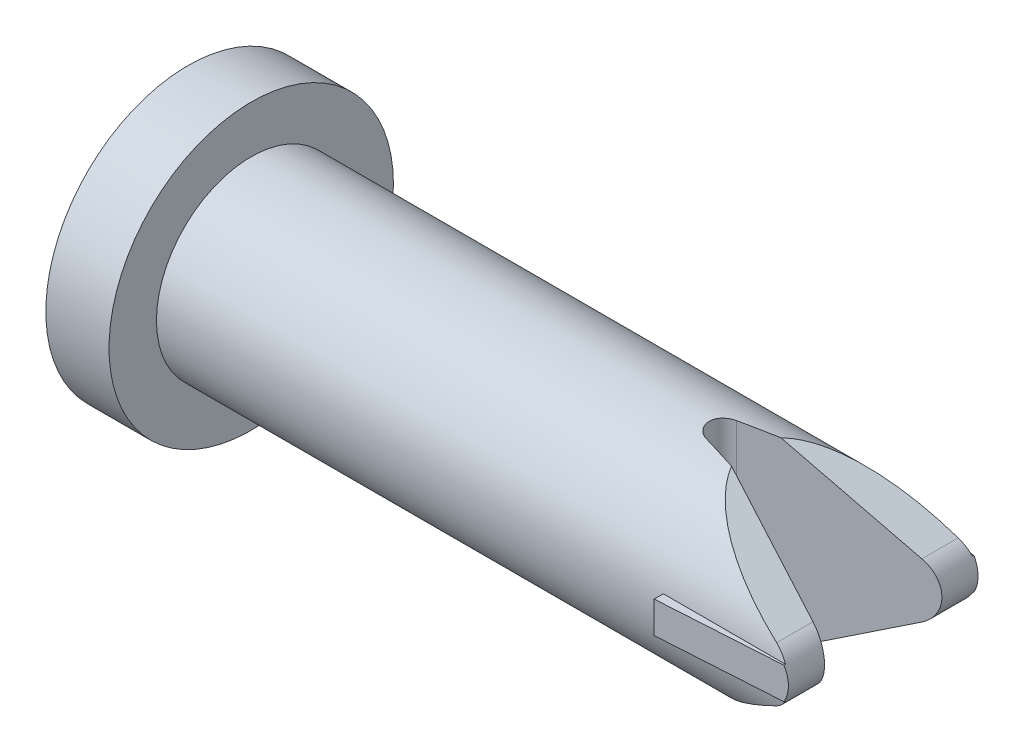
ISO-10303-21;
HEADER;
FILE_DESCRIPTION(('STEP AP214'),'2;1');
FILE_NAME('part.step','',(''),(''),'','','');
FILE_SCHEMA(('AUTOMOTIVE_DESIGN { 1 0 10303 214 1 1 1 1 }'));
ENDSEC;
DATA;
#1=APPLICATION_CONTEXT('core data for automotive mechanical design processes');
#2=APPLICATION_PROTOCOL_DEFINITION('international standard','automotive_design',2000,#1);
#3=PRODUCT_CONTEXT('',#1,'mechanical');
#4=PRODUCT('Part','Part','',(#3));
#5=PRODUCT_RELATED_PRODUCT_CATEGORY('part','',(#4));
#6=PRODUCT_DEFINITION_FORMATION('','',#4);
#7=PRODUCT_DEFINITION_CONTEXT('part definition',#1,'design');
#8=PRODUCT_DEFINITION('design','',#6,#7);
#9=PRODUCT_DEFINITION_SHAPE('','',#8);
#10=(LENGTH_UNIT() NAMED_UNIT(*) SI_UNIT(.MILLI.,.METRE.));
#11=(NAMED_UNIT(*) PLANE_ANGLE_UNIT() SI_UNIT($,.RADIAN.));
#12=(NAMED_UNIT(*) SI_UNIT($,.STERADIAN.) SOLID_ANGLE_UNIT());
#13=UNCERTAINTY_MEASURE_WITH_UNIT(LENGTH_MEASURE(1.E-05),#10,'distance_accuracy_value','');
#14=(GEOMETRIC_REPRESENTATION_CONTEXT(3) GLOBAL_UNCERTAINTY_ASSIGNED_CONTEXT((#13)) GLOBAL_UNIT_ASSIGNED_CONTEXT((#10,
#11,#12)) REPRESENTATION_CONTEXT('',''));
#15=CARTESIAN_POINT('',(0.,0.,0.));
#16=DIRECTION('',(0.,0.,1.));
#17=DIRECTION('',(1.,0.,0.));
#18=AXIS2_PLACEMENT_3D('',#15,#16,#17);
#19=CARTESIAN_POINT('',(-2.,0.,0.));
#20=DIRECTION('',(1.,0.,0.));
#21=DIRECTION('',(0.,0.,-1.));
#22=AXIS2_PLACEMENT_3D('',#19,#20,#21);
#23=PLANE('',#22);
#24=CARTESIAN_POINT('',(-2.,0.,0.));
#25=DIRECTION('',(1.,0.,0.));
#26=DIRECTION('',(0.,0.,-1.));
#27=AXIS2_PLACEMENT_3D('',#24,#25,#26);
#28=CIRCLE('',#27,4.5);
#29=CARTESIAN_POINT('',(-2.,0.,-4.5));
#30=VERTEX_POINT('',#29);
#31=EDGE_CURVE('E139',#30,#30,#28,.T.);
#32=ORIENTED_EDGE('',*,*,#31,.F.);
#33=EDGE_LOOP('',(#32));
#34=FACE_BOUND('',#33,.T.);
#35=ADVANCED_FACE('F16',(#34),#23,.F.);
#36=CARTESIAN_POINT('',(15.,-5.405410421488,0.));
#37=DIRECTION('',(0.,1.,0.));
#38=DIRECTION('',(0.,0.,1.));
#39=AXIS2_PLACEMENT_3D('',#36,#37,#38);
#40=CYLINDRICAL_SURFACE('',#39,0.5);
#41=CARTESIAN_POINT('',(14.8705904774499,2.96086926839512,0.482962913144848));
#42=CARTESIAN_POINT('',(14.8433974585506,2.96204708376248,0.475700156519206));
#43=CARTESIAN_POINT('',(14.8168590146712,2.96359160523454,0.466106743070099));
#44=CARTESIAN_POINT('',(14.7658104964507,2.96718951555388,0.442648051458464));
#45=CARTESIAN_POINT('',(14.7412983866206,2.96924238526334,0.428787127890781));
#46=CARTESIAN_POINT('',(14.6949598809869,2.97363610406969,0.397163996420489));
#47=CARTESIAN_POINT('',(14.6731339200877,2.97597699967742,0.379401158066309));
#48=CARTESIAN_POINT('',(14.6327649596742,2.98068115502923,0.340476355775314));
#49=CARTESIAN_POINT('',(14.6142217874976,2.9830444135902,0.319314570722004));
#50=CARTESIAN_POINT('',(14.5808342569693,2.98754473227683,0.274036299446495));
#51=CARTESIAN_POINT('',(14.5660118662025,2.98968040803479,0.249903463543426));
#52=CARTESIAN_POINT('',(14.5406344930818,2.99346932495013,0.19945082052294));
#53=CARTESIAN_POINT('',(14.5300797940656,2.99512253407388,0.173130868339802));
#54=CARTESIAN_POINT('',(14.51361407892,2.99775001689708,0.119236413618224));
#55=CARTESIAN_POINT('',(14.507672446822,2.99872876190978,0.0916714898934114));
#56=CARTESIAN_POINT('',(14.5005009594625,2.9999144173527,0.0359216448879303));
#57=CARTESIAN_POINT('',(14.4992704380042,3.00012143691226,0.00773681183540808));
#58=CARTESIAN_POINT('',(14.5015448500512,2.99974273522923,-0.0481102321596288));
#59=CARTESIAN_POINT('',(14.5049956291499,2.99916607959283,-0.0757747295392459));
#60=CARTESIAN_POINT('',(14.5164314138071,2.99729996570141,-0.130125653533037));
#61=CARTESIAN_POINT('',(14.5244166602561,2.9960104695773,-0.156812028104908));
#62=CARTESIAN_POINT('',(14.5446970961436,2.99285830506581,-0.208497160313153));
#63=CARTESIAN_POINT('',(14.556998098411,2.99099486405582,-0.233493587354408));
#64=CARTESIAN_POINT('',(14.5855562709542,2.98689882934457,-0.281080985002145));
#65=CARTESIAN_POINT('',(14.6018137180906,2.98466620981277,-0.303671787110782));
#66=CARTESIAN_POINT('',(14.6380581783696,2.98004624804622,-0.34610154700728));
#67=CARTESIAN_POINT('',(14.6580886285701,2.97765733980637,-0.36590321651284));
#68=CARTESIAN_POINT('',(14.7011933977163,2.97301653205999,-0.401873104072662));
#69=CARTESIAN_POINT('',(14.7242667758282,2.97076459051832,-0.418042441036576));
#70=CARTESIAN_POINT('',(14.7676294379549,2.96709210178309,-0.443274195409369));
#71=CARTESIAN_POINT('',(14.7874631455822,2.9655966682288,-0.453116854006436));
#72=CARTESIAN_POINT('',(14.828260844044,2.96295020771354,-0.470101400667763));
#73=CARTESIAN_POINT('',(14.8492240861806,2.96179895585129,-0.477245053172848));
#74=CARTESIAN_POINT('',(14.8705904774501,2.96086926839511,-0.482962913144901));
#75=B_SPLINE_CURVE_WITH_KNOTS('',3,(#41,#42,#43,#44,#45,#46,#47,#48,#49,#50,#51,#52,#53,#54,#55,
#56,#57,#58,#59,#60,#61,#62,#63,#64,#65,#66,#67,#68,#69,#70,#71,#72,#73,#74),.UNSPECIFIED.,.F.,
.F.,(4,2,2,2,2,2,2,2,2,2,2,2,2,2,2,2,4),(0.,0.0843886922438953,0.168691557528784,
0.2530080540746,0.337320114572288,0.42211882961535,0.50692317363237,0.59115976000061,
0.67538443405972,0.758643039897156,0.841906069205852,0.925281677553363,1.00866312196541,
1.09307073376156,1.17745230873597,1.24383939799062,1.31018301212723),.UNSPECIFIED.);
#76=CARTESIAN_POINT('',(14.87059047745,2.96086926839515,0.482962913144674));
#77=VERTEX_POINT('',#76);
#78=CARTESIAN_POINT('',(14.87059047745,2.96086926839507,-0.482962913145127));
#79=VERTEX_POINT('',#78);
#80=EDGE_CURVE('E149',#77,#79,#75,.T.);
#81=ORIENTED_EDGE('',*,*,#80,.F.);
#82=DIRECTION('',(0.,1.,0.));
#83=VECTOR('',#82,1.);
#84=CARTESIAN_POINT('',(14.87059047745,-5.405410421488,0.4829629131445));
#85=LINE('',#84,#83);
#86=CARTESIAN_POINT('',(14.87059047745,-2.96086926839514,0.482962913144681));
#87=VERTEX_POINT('',#86);
#88=EDGE_CURVE('E147',#77,#87,#85,.F.);
#89=ORIENTED_EDGE('',*,*,#88,.T.);
#90=CARTESIAN_POINT('',(14.8705904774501,-2.96086926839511,-0.482962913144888));
#91=CARTESIAN_POINT('',(14.8433974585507,-2.96204708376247,-0.475700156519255));
#92=CARTESIAN_POINT('',(14.8168590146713,-2.96359160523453,-0.466106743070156));
#93=CARTESIAN_POINT('',(14.7658104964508,-2.96718951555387,-0.442648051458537));
#94=CARTESIAN_POINT('',(14.7412983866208,-2.96924238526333,-0.428787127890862));
#95=CARTESIAN_POINT('',(14.694959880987,-2.97363610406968,-0.397163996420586));
#96=CARTESIAN_POINT('',(14.6731339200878,-2.97597699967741,-0.379401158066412));
#97=CARTESIAN_POINT('',(14.6327649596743,-2.98068115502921,-0.34047635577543));
#98=CARTESIAN_POINT('',(14.6142217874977,-2.98304441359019,-0.319314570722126));
#99=CARTESIAN_POINT('',(14.5808342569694,-2.98754473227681,-0.274036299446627));
#100=CARTESIAN_POINT('',(14.5660118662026,-2.98968040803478,-0.249903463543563));
#101=CARTESIAN_POINT('',(14.5406344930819,-2.99346932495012,-0.199450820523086));
#102=CARTESIAN_POINT('',(14.5300797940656,-2.99512253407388,-0.173130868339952));
#103=CARTESIAN_POINT('',(14.5136140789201,-2.99775001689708,-0.11923641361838));
#104=CARTESIAN_POINT('',(14.507672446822,-2.99872876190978,-0.091671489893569));
#105=CARTESIAN_POINT('',(14.5005009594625,-2.9999144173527,-0.0359216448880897));
#106=CARTESIAN_POINT('',(14.4992704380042,-3.00012143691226,-0.00773681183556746));
#107=CARTESIAN_POINT('',(14.5015448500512,-2.99974273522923,0.0481102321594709));
#108=CARTESIAN_POINT('',(14.5049956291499,-2.99916607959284,0.0757747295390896));
#109=CARTESIAN_POINT('',(14.5164314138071,-2.99729996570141,0.130125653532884));
#110=CARTESIAN_POINT('',(14.5244166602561,-2.99601046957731,0.156812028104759));
#111=CARTESIAN_POINT('',(14.5446970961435,-2.99285830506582,0.20849716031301));
#112=CARTESIAN_POINT('',(14.556998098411,-2.99099486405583,0.233493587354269));
#113=CARTESIAN_POINT('',(14.5855562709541,-2.98689882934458,0.281080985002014));
#114=CARTESIAN_POINT('',(14.6018137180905,-2.98466620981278,0.303671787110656));
#115=CARTESIAN_POINT('',(14.6380581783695,-2.98004624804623,0.346101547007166));
#116=CARTESIAN_POINT('',(14.65808862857,-2.97765733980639,0.365903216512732));
#117=CARTESIAN_POINT('',(14.7011933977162,-2.97301653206,0.401873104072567));
#118=CARTESIAN_POINT('',(14.724266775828,-2.97076459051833,0.418042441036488));
#119=CARTESIAN_POINT('',(14.7676294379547,-2.9670921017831,0.443274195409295));
#120=CARTESIAN_POINT('',(14.787463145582,-2.96559666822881,0.453116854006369));
#121=CARTESIAN_POINT('',(14.8282608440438,-2.96295020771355,0.470101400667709));
#122=CARTESIAN_POINT('',(14.8492240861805,-2.9617989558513,0.477245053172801));
#123=CARTESIAN_POINT('',(14.87059047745,-2.96086926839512,0.482962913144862));
#124=B_SPLINE_CURVE_WITH_KNOTS('',3,(#90,#91,#92,#93,#94,#95,#96,#97,#98,#99,#100,#101,#102,
#103,#104,#105,#106,#107,#108,#109,#110,#111,#112,#113,#114,#115,#116,#117,#118,#119,#120,#121,
#122,#123),.UNSPECIFIED.,.F.,.F.,(4,2,2,2,2,2,2,2,2,2,2,2,2,2,2,2,4),(0.,0.0843886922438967,
0.168691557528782,0.253008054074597,0.337320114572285,0.422118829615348,0.506923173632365,
0.591159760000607,0.675384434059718,0.758643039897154,0.841906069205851,0.92528167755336,
1.00866312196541,1.09307073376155,1.17745230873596,1.24383939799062,1.31018301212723),.UNSPECIFIED.);
#125=CARTESIAN_POINT('',(14.87059047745,-2.96086926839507,-0.482962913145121));
#126=VERTEX_POINT('',#125);
#127=EDGE_CURVE('E21',#126,#87,#124,.T.);
#128=ORIENTED_EDGE('',*,*,#127,.F.);
#129=DIRECTION('',(0.,1.,0.));
#130=VECTOR('',#129,1.);
#131=CARTESIAN_POINT('',(14.8705904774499,-5.405410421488,-0.482962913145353));
#132=LINE('',#131,#130);
#133=EDGE_CURVE('E138',#126,#79,#132,.T.);
#134=ORIENTED_EDGE('',*,*,#133,.T.);
#135=EDGE_LOOP('',(#81,#89,#128,#134));
#136=FACE_BOUND('',#135,.T.);
#137=ADVANCED_FACE('F144',(#136),#40,.F.);
#138=CARTESIAN_POINT('',(0.,0.,0.));
#139=DIRECTION('',(1.,0.,0.));
#140=DIRECTION('',(0.,0.,-1.));
#141=AXIS2_PLACEMENT_3D('',#138,#139,#140);
#142=CYLINDRICAL_SURFACE('',#141,4.5);
#143=CARTESIAN_POINT('',(0.,0.,0.));
#144=DIRECTION('',(1.,0.,0.));
#145=DIRECTION('',(0.,0.,-1.));
#146=AXIS2_PLACEMENT_3D('',#143,#144,#145);
#147=CIRCLE('',#146,4.5);
#148=CARTESIAN_POINT('',(0.,0.,-4.5));
#149=VERTEX_POINT('',#148);
#150=EDGE_CURVE('E179',#149,#149,#147,.T.);
#151=ORIENTED_EDGE('',*,*,#150,.F.);
#152=EDGE_LOOP('',(#151));
#153=FACE_BOUND('',#152,.T.);
#154=ORIENTED_EDGE('',*,*,#31,.T.);
#155=EDGE_LOOP('',(#154));
#156=FACE_BOUND('',#155,.T.);
#157=ADVANCED_FACE('F301',(#153,#156),#142,.T.);
#158=CARTESIAN_POINT('',(20.,-0.5,-3.));
#159=DIRECTION('',(0.0623782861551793,0.,-0.998052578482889));
#160=DIRECTION('',(-0.998052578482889,0.,-0.0623782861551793));
#161=AXIS2_PLACEMENT_3D('',#158,#159,#160);
#162=PLANE('',#161);
#163=DIRECTION('',(0.,1.,0.));
#164=VECTOR('',#163,1.);
#165=CARTESIAN_POINT('',(16.,-0.5,-3.25));
#166=LINE('',#165,#164);
#167=CARTESIAN_POINT('',(16.,0.5,-3.25));
#168=VERTEX_POINT('',#167);
#169=CARTESIAN_POINT('',(16.,-0.5,-3.25));
#170=VERTEX_POINT('',#169);
#171=EDGE_CURVE('E178',#168,#170,#166,.F.);
#172=ORIENTED_EDGE('',*,*,#171,.F.);
#173=DIRECTION('',(-0.998052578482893,0.,-0.0623782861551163));
#174=VECTOR('',#173,1.);
#175=CARTESIAN_POINT('',(19.86602540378,0.5,-3.008373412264));
#176=LINE('',#175,#174);
#177=CARTESIAN_POINT('',(19.8660254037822,0.5,-3.00837341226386));
#178=VERTEX_POINT('',#177);
#179=EDGE_CURVE('E231',#178,#168,#176,.T.);
#180=ORIENTED_EDGE('',*,*,#179,.F.);
#181=CARTESIAN_POINT('',(19.,0.,-3.0625));
#182=DIRECTION('',(0.0623782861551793,0.,-0.998052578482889));
#183=DIRECTION('',(0.998052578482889,0.,0.0623782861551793));
#184=AXIS2_PLACEMENT_3D('',#181,#182,#183);
#185=ELLIPSE('',#184,1.00195122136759,1.);
#186=CARTESIAN_POINT('',(19.8660254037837,-0.500000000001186,-3.00837341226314));
#187=VERTEX_POINT('',#186);
#188=EDGE_CURVE('E170',#187,#178,#185,.F.);
#189=ORIENTED_EDGE('',*,*,#188,.F.);
#190=DIRECTION('',(-0.998052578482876,0.,-0.0623782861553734));
#191=VECTOR('',#190,1.);
#192=CARTESIAN_POINT('',(19.86602540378,-0.5,-3.008373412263));
#193=LINE('',#192,#191);
#194=EDGE_CURVE('E226',#187,#170,#193,.T.);
#195=ORIENTED_EDGE('',*,*,#194,.T.);
#196=EDGE_LOOP('',(#172,#180,#189,#195));
#197=FACE_BOUND('',#196,.T.);
#198=ADVANCED_FACE('F305',(#197),#162,.T.);
#199=CARTESIAN_POINT('',(20.,-5.405410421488,-1.857384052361));
#200=DIRECTION('',(-0.258819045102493,0.,-0.965925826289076));
#201=DIRECTION('',(-0.965925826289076,0.,0.258819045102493));
#202=AXIS2_PLACEMENT_3D('',#199,#200,#201);
#203=PLANE('',#202);
#204=CARTESIAN_POINT('',(19.,0.,-1.58943485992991));
#205=DIRECTION('',(-0.258819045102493,0.,-0.965925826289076));
#206=DIRECTION('',(-0.965925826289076,0.,0.258819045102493));
#207=AXIS2_PLACEMENT_3D('',#204,#205,#206);
#208=ELLIPSE('',#207,1.03527618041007,1.);
#209=CARTESIAN_POINT('',(19.4999999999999,0.866025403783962,-1.72340945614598));
#210=VERTEX_POINT('',#209);
#211=CARTESIAN_POINT('',(19.5000000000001,-0.866025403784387,-1.72340945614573));
#212=VERTEX_POINT('',#211);
#213=EDGE_CURVE('E186',#210,#212,#208,.T.);
#214=ORIENTED_EDGE('',*,*,#213,.F.);
#215=DIRECTION('',(-0.843610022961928,0.487058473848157,0.226044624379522));
#216=VECTOR('',#215,1.);
#217=CARTESIAN_POINT('',(19.4999999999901,0.866025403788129,-1.723409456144));
#218=LINE('',#217,#216);
#219=CARTESIAN_POINT('',(15.9830367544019,2.89654508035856,-0.781041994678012));
#220=VERTEX_POINT('',#219);
#221=EDGE_CURVE('E167',#210,#220,#218,.T.);
#222=ORIENTED_EDGE('',*,*,#221,.T.);
#223=CARTESIAN_POINT('',(13.0681483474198,0.,0.));
#224=DIRECTION('',(-0.258819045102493,0.,-0.965925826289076));
#225=DIRECTION('',(0.965925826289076,0.,-0.258819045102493));
#226=AXIS2_PLACEMENT_3D('',#223,#224,#225);
#227=ELLIPSE('',#226,11.59110991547,3.);
#228=EDGE_CURVE('E152',#79,#220,#227,.T.);
#229=ORIENTED_EDGE('',*,*,#228,.F.);
#230=ORIENTED_EDGE('',*,*,#133,.F.);
#231=CARTESIAN_POINT('',(13.0681483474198,0.,0.));
#232=DIRECTION('',(-0.258819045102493,0.,-0.965925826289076));
#233=DIRECTION('',(0.965925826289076,0.,-0.258819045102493));
#234=AXIS2_PLACEMENT_3D('',#231,#232,#233);
#235=ELLIPSE('',#234,11.59110991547,3.);
#236=CARTESIAN_POINT('',(15.9830367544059,-2.89654508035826,-0.781041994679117));
#237=VERTEX_POINT('',#236);
#238=EDGE_CURVE('E126',#237,#126,#235,.T.);
#239=ORIENTED_EDGE('',*,*,#238,.F.);
#240=DIRECTION('',(0.843610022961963,0.487058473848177,-0.226044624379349));
#241=VECTOR('',#240,1.);
#242=CARTESIAN_POINT('',(15.9830367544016,-2.89654508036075,-0.7810419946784));
#243=LINE('',#242,#241);
#244=EDGE_CURVE('E187',#237,#212,#243,.T.);
#245=ORIENTED_EDGE('',*,*,#244,.T.);
#246=EDGE_LOOP('',(#214,#222,#229,#230,#239,#245));
#247=FACE_BOUND('',#246,.T.);
#248=ADVANCED_FACE('F150',(#247),#203,.F.);
#249=CARTESIAN_POINT('',(14.87059047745,-5.405410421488,0.4829629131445));
#250=DIRECTION('',(-0.258819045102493,0.,0.965925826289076));
#251=DIRECTION('',(0.965925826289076,0.,0.258819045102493));
#252=AXIS2_PLACEMENT_3D('',#249,#250,#251);
#253=PLANE('',#252);
#254=CARTESIAN_POINT('',(13.068148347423,0.,0.));
#255=DIRECTION('',(-0.258819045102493,0.,0.965925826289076));
#256=DIRECTION('',(0.965925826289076,0.,0.258819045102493));
#257=AXIS2_PLACEMENT_3D('',#254,#255,#256);
#258=ELLIPSE('',#257,11.59110991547,3.);
#259=CARTESIAN_POINT('',(15.9830367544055,-2.89654508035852,0.78104199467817));
#260=VERTEX_POINT('',#259);
#261=EDGE_CURVE('E158',#87,#260,#258,.T.);
#262=ORIENTED_EDGE('',*,*,#261,.F.);
#263=ORIENTED_EDGE('',*,*,#88,.F.);
#264=CARTESIAN_POINT('',(13.068148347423,0.,0.));
#265=DIRECTION('',(-0.258819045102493,0.,0.965925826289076));
#266=DIRECTION('',(0.965925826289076,0.,0.258819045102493));
#267=AXIS2_PLACEMENT_3D('',#264,#265,#266);
#268=ELLIPSE('',#267,11.59110991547,3.);
#269=CARTESIAN_POINT('',(15.9830367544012,2.89654508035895,0.781041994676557));
#270=VERTEX_POINT('',#269);
#271=EDGE_CURVE('E154',#270,#77,#268,.T.);
#272=ORIENTED_EDGE('',*,*,#271,.F.);
#273=DIRECTION('',(0.843610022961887,-0.487058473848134,0.226044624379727));
#274=VECTOR('',#273,1.);
#275=CARTESIAN_POINT('',(15.9830367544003,2.8965450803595,0.7810419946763));
#276=LINE('',#275,#274);
#277=CARTESIAN_POINT('',(19.5000000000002,0.866025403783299,1.72340945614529));
#278=VERTEX_POINT('',#277);
#279=EDGE_CURVE('E164',#270,#278,#276,.T.);
#280=ORIENTED_EDGE('',*,*,#279,.T.);
#281=CARTESIAN_POINT('',(19.,0.,1.58943485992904));
#282=DIRECTION('',(-0.258819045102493,0.,0.965925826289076));
#283=DIRECTION('',(0.965925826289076,0.,0.258819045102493));
#284=AXIS2_PLACEMENT_3D('',#281,#282,#283);
#285=ELLIPSE('',#284,1.03527618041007,1.);
#286=CARTESIAN_POINT('',(19.5,-0.866025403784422,1.72340945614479));
#287=VERTEX_POINT('',#286);
#288=EDGE_CURVE('E163',#287,#278,#285,.T.);
#289=ORIENTED_EDGE('',*,*,#288,.F.);
#290=DIRECTION('',(-0.843610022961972,-0.487058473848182,-0.226044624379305));
#291=VECTOR('',#290,1.);
#292=CARTESIAN_POINT('',(19.5,-0.8660254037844,1.723409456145));
#293=LINE('',#292,#291);
#294=EDGE_CURVE('E189',#287,#260,#293,.T.);
#295=ORIENTED_EDGE('',*,*,#294,.T.);
#296=EDGE_LOOP('',(#262,#263,#272,#280,#289,#295));
#297=FACE_BOUND('',#296,.T.);
#298=ADVANCED_FACE('F312',(#297),#253,.F.);
#299=CARTESIAN_POINT('',(16.,-0.5,3.25));
#300=DIRECTION('',(0.0623782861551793,0.,0.998052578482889));
#301=DIRECTION('',(0.998052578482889,0.,-0.0623782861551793));
#302=AXIS2_PLACEMENT_3D('',#299,#300,#301);
#303=PLANE('',#302);
#304=DIRECTION('',(0.,1.,0.));
#305=VECTOR('',#304,1.);
#306=CARTESIAN_POINT('',(16.,-0.5,3.25));
#307=LINE('',#306,#305);
#308=CARTESIAN_POINT('',(16.,0.5,3.25));
#309=VERTEX_POINT('',#308);
#310=CARTESIAN_POINT('',(16.,-0.5,3.25));
#311=VERTEX_POINT('',#310);
#312=EDGE_CURVE('E235',#309,#311,#307,.F.);
#313=ORIENTED_EDGE('',*,*,#312,.T.);
#314=DIRECTION('',(0.998052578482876,0.,-0.0623782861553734));
#315=VECTOR('',#314,1.);
#316=CARTESIAN_POINT('',(16.,-0.5,3.25));
#317=LINE('',#316,#315);
#318=CARTESIAN_POINT('',(19.8660254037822,-0.5,3.00837341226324));
#319=VERTEX_POINT('',#318);
#320=EDGE_CURVE('E197',#311,#319,#317,.T.);
#321=ORIENTED_EDGE('',*,*,#320,.T.);
#322=CARTESIAN_POINT('',(19.,0.,3.0625));
#323=DIRECTION('',(0.0623782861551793,0.,0.998052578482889));
#324=DIRECTION('',(-0.998052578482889,0.,0.0623782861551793));
#325=AXIS2_PLACEMENT_3D('',#322,#323,#324);
#326=ELLIPSE('',#325,1.00195122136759,1.);
#327=CARTESIAN_POINT('',(19.8660254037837,0.500000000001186,3.00837341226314));
#328=VERTEX_POINT('',#327);
#329=EDGE_CURVE('E193',#328,#319,#326,.F.);
#330=ORIENTED_EDGE('',*,*,#329,.F.);
#331=DIRECTION('',(0.998052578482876,0.,-0.0623782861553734));
#332=VECTOR('',#331,1.);
#333=CARTESIAN_POINT('',(16.,0.5,3.25));
#334=LINE('',#333,#332);
#335=EDGE_CURVE('E232',#309,#328,#334,.T.);
#336=ORIENTED_EDGE('',*,*,#335,.F.);
#337=EDGE_LOOP('',(#313,#321,#330,#336));
#338=FACE_BOUND('',#337,.T.);
#339=ADVANCED_FACE('F315',(#338),#303,.T.);
#340=CARTESIAN_POINT('',(0.,0.5,0.));
#341=DIRECTION('',(0.,1.,0.));
#342=DIRECTION('',(0.,0.,1.));
#343=AXIS2_PLACEMENT_3D('',#340,#341,#342);
#344=PLANE('',#343);
#345=DIRECTION('',(0.,0.,1.));
#346=VECTOR('',#345,1.);
#347=CARTESIAN_POINT('',(16.,0.5,-3.25));
#348=LINE('',#347,#346);
#349=CARTESIAN_POINT('',(16.,0.499999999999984,2.95803989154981));
#350=VERTEX_POINT('',#349);
#351=EDGE_CURVE('E198',#309,#350,#348,.F.);
#352=ORIENTED_EDGE('',*,*,#351,.F.);
#353=ORIENTED_EDGE('',*,*,#335,.T.);
#354=DIRECTION('',(0.,0.,1.));
#355=VECTOR('',#354,1.);
#356=CARTESIAN_POINT('',(19.8660254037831,0.500000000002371,-5.4));
#357=LINE('',#356,#355);
#358=CARTESIAN_POINT('',(19.8660254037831,0.500000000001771,2.95803989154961));
#359=VERTEX_POINT('',#358);
#360=EDGE_CURVE('E159',#359,#328,#357,.T.);
#361=ORIENTED_EDGE('',*,*,#360,.F.);
#362=DIRECTION('',(1.,0.,0.));
#363=VECTOR('',#362,1.);
#364=CARTESIAN_POINT('',(0.,0.499999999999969,2.95803989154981));
#365=LINE('',#364,#363);
#366=EDGE_CURVE('E201',#350,#359,#365,.T.);
#367=ORIENTED_EDGE('',*,*,#366,.F.);
#368=EDGE_LOOP('',(#352,#353,#361,#367));
#369=FACE_BOUND('',#368,.T.);
#370=ADVANCED_FACE('F319',(#369),#344,.T.);
#371=CARTESIAN_POINT('',(15.80384757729,3.,-5.4));
#372=DIRECTION('',(-0.500000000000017,-0.866025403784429,0.));
#373=DIRECTION('',(0.866025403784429,-0.500000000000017,0.));
#374=AXIS2_PLACEMENT_3D('',#371,#372,#373);
#375=PLANE('',#374);
#376=CARTESIAN_POINT('',(20.9999999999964,0.,0.));
#377=DIRECTION('',(-0.500000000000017,-0.866025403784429,0.));
#378=DIRECTION('',(0.866025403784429,-0.500000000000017,0.));
#379=AXIS2_PLACEMENT_3D('',#376,#377,#378);
#380=ELLIPSE('',#379,5.9999999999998,3.);
#381=CARTESIAN_POINT('',(19.5000000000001,0.866025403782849,2.87228132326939));
#382=VERTEX_POINT('',#381);
#383=EDGE_CURVE('E282',#382,#270,#380,.T.);
#384=ORIENTED_EDGE('',*,*,#383,.F.);
#385=DIRECTION('',(0.,0.,1.));
#386=VECTOR('',#385,1.);
#387=CARTESIAN_POINT('',(19.5000000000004,0.866025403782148,-5.4));
#388=LINE('',#387,#386);
#389=EDGE_CURVE('E162',#278,#382,#388,.T.);
#390=ORIENTED_EDGE('',*,*,#389,.F.);
#391=ORIENTED_EDGE('',*,*,#279,.F.);
#392=EDGE_LOOP('',(#384,#390,#391));
#393=FACE_BOUND('',#392,.T.);
#394=ADVANCED_FACE('F323',(#393),#375,.F.);
#395=CARTESIAN_POINT('',(15.80384757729,3.,-5.4));
#396=DIRECTION('',(-0.500000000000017,-0.866025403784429,0.));
#397=DIRECTION('',(0.866025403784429,-0.500000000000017,0.));
#398=AXIS2_PLACEMENT_3D('',#395,#396,#397);
#399=PLANE('',#398);
#400=DIRECTION('',(0.,0.,1.));
#401=VECTOR('',#400,1.);
#402=CARTESIAN_POINT('',(19.5000000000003,0.866025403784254,-5.4));
#403=LINE('',#402,#401);
#404=CARTESIAN_POINT('',(19.5000000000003,0.866025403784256,-2.8722813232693));
#405=VERTEX_POINT('',#404);
#406=EDGE_CURVE('E171',#405,#210,#403,.T.);
#407=ORIENTED_EDGE('',*,*,#406,.F.);
#408=CARTESIAN_POINT('',(20.9999999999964,0.,0.));
#409=DIRECTION('',(-0.500000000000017,-0.866025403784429,0.));
#410=DIRECTION('',(0.866025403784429,-0.500000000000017,0.));
#411=AXIS2_PLACEMENT_3D('',#408,#409,#410);
#412=ELLIPSE('',#411,5.9999999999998,3.);
#413=EDGE_CURVE('E365',#220,#405,#412,.T.);
#414=ORIENTED_EDGE('',*,*,#413,.F.);
#415=ORIENTED_EDGE('',*,*,#221,.F.);
#416=EDGE_LOOP('',(#407,#414,#415));
#417=FACE_BOUND('',#416,.T.);
#418=ADVANCED_FACE('F327',(#417),#399,.F.);
#419=CARTESIAN_POINT('',(0.,0.5,0.));
#420=DIRECTION('',(0.,1.,0.));
#421=DIRECTION('',(0.,0.,1.));
#422=AXIS2_PLACEMENT_3D('',#419,#420,#421);
#423=PLANE('',#422);
#424=DIRECTION('',(0.,0.,1.));
#425=VECTOR('',#424,1.);
#426=CARTESIAN_POINT('',(16.,0.5,-3.25));
#427=LINE('',#426,#425);
#428=CARTESIAN_POINT('',(16.,0.500000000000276,-2.95803989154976));
#429=VERTEX_POINT('',#428);
#430=EDGE_CURVE('E175',#429,#168,#427,.F.);
#431=ORIENTED_EDGE('',*,*,#430,.F.);
#432=DIRECTION('',(1.,0.,0.));
#433=VECTOR('',#432,1.);
#434=CARTESIAN_POINT('',(0.,0.500000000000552,-2.95803989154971));
#435=LINE('',#434,#433);
#436=CARTESIAN_POINT('',(19.8660254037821,0.500000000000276,-2.95803989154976));
#437=VERTEX_POINT('',#436);
#438=EDGE_CURVE('E208',#437,#429,#435,.F.);
#439=ORIENTED_EDGE('',*,*,#438,.F.);
#440=DIRECTION('',(0.,0.,1.));
#441=VECTOR('',#440,1.);
#442=CARTESIAN_POINT('',(19.86602540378,0.5,0.));
#443=LINE('',#442,#441);
#444=EDGE_CURVE('E174',#437,#178,#443,.F.);
#445=ORIENTED_EDGE('',*,*,#444,.T.);
#446=ORIENTED_EDGE('',*,*,#179,.T.);
#447=EDGE_LOOP('',(#431,#439,#445,#446));
#448=FACE_BOUND('',#447,.T.);
#449=ADVANCED_FACE('F331',(#448),#423,.T.);
#450=CARTESIAN_POINT('',(0.,0.,0.));
#451=DIRECTION('',(1.,0.,0.));
#452=DIRECTION('',(0.,0.,-1.));
#453=AXIS2_PLACEMENT_3D('',#450,#451,#452);
#454=PLANE('',#453);
#455=CARTESIAN_POINT('',(0.,0.,0.));
#456=DIRECTION('',(1.,0.,0.));
#457=DIRECTION('',(0.,0.,-1.));
#458=AXIS2_PLACEMENT_3D('',#455,#456,#457);
#459=CIRCLE('',#458,3.);
#460=CARTESIAN_POINT('',(0.,0.,-3.));
#461=VERTEX_POINT('',#460);
#462=EDGE_CURVE('E210',#461,#461,#459,.T.);
#463=ORIENTED_EDGE('',*,*,#462,.F.);
#464=EDGE_LOOP('',(#463));
#465=FACE_BOUND('',#464,.T.);
#466=ORIENTED_EDGE('',*,*,#150,.T.);
#467=EDGE_LOOP('',(#466));
#468=FACE_BOUND('',#467,.T.);
#469=ADVANCED_FACE('F335',(#465,#468),#454,.T.);
#470=CARTESIAN_POINT('',(16.,-0.5,-3.25));
#471=DIRECTION('',(-1.,0.,0.));
#472=DIRECTION('',(0.,0.,1.));
#473=AXIS2_PLACEMENT_3D('',#470,#471,#472);
#474=PLANE('',#473);
#475=CARTESIAN_POINT('',(16.,0.,0.));
#476=DIRECTION('',(1.,0.,0.));
#477=DIRECTION('',(0.,0.,-1.));
#478=AXIS2_PLACEMENT_3D('',#475,#476,#477);
#479=CIRCLE('',#478,3.);
#480=CARTESIAN_POINT('',(16.,-0.499999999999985,-2.95803989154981));
#481=VERTEX_POINT('',#480);
#482=EDGE_CURVE('E222',#429,#481,#479,.F.);
#483=ORIENTED_EDGE('',*,*,#482,.F.);
#484=ORIENTED_EDGE('',*,*,#430,.T.);
#485=ORIENTED_EDGE('',*,*,#171,.T.);
#486=DIRECTION('',(0.,0.,1.));
#487=VECTOR('',#486,1.);
#488=CARTESIAN_POINT('',(16.,-0.5,0.));
#489=LINE('',#488,#487);
#490=EDGE_CURVE('E224',#170,#481,#489,.T.);
#491=ORIENTED_EDGE('',*,*,#490,.T.);
#492=EDGE_LOOP('',(#483,#484,#485,#491));
#493=FACE_BOUND('',#492,.T.);
#494=ADVANCED_FACE('F339',(#493),#474,.T.);
#495=CARTESIAN_POINT('',(0.,-0.5,0.));
#496=DIRECTION('',(0.,1.,0.));
#497=DIRECTION('',(0.,0.,1.));
#498=AXIS2_PLACEMENT_3D('',#495,#496,#497);
#499=PLANE('',#498);
#500=DIRECTION('',(0.,0.,1.));
#501=VECTOR('',#500,1.);
#502=CARTESIAN_POINT('',(19.8660254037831,-0.500000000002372,-5.4));
#503=LINE('',#502,#501);
#504=CARTESIAN_POINT('',(19.8660254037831,-0.500000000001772,-2.95803989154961));
#505=VERTEX_POINT('',#504);
#506=EDGE_CURVE('E182',#505,#187,#503,.F.);
#507=ORIENTED_EDGE('',*,*,#506,.F.);
#508=DIRECTION('',(1.,0.,0.));
#509=VECTOR('',#508,1.);
#510=CARTESIAN_POINT('',(0.,-0.49999999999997,-2.95803989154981));
#511=LINE('',#510,#509);
#512=EDGE_CURVE('E218',#481,#505,#511,.T.);
#513=ORIENTED_EDGE('',*,*,#512,.F.);
#514=ORIENTED_EDGE('',*,*,#490,.F.);
#515=ORIENTED_EDGE('',*,*,#194,.F.);
#516=EDGE_LOOP('',(#507,#513,#514,#515));
#517=FACE_BOUND('',#516,.T.);
#518=ADVANCED_FACE('F343',(#517),#499,.F.);
#519=CARTESIAN_POINT('',(19.,0.,-5.4));
#520=DIRECTION('',(0.,0.,1.));
#521=DIRECTION('',(1.,0.,0.));
#522=AXIS2_PLACEMENT_3D('',#519,#520,#521);
#523=CYLINDRICAL_SURFACE('',#522,1.);
#524=ORIENTED_EDGE('',*,*,#506,.T.);
#525=ORIENTED_EDGE('',*,*,#188,.T.);
#526=ORIENTED_EDGE('',*,*,#444,.F.);
#527=CARTESIAN_POINT('',(19.5000000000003,0.866025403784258,-2.87228132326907));
#528=CARTESIAN_POINT('',(19.5498388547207,0.83729616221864,-2.88095008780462));
#529=CARTESIAN_POINT('',(19.5970611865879,0.80425858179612,-2.89043786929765));
#530=CARTESIAN_POINT('',(19.6841850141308,0.731453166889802,-2.90969925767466));
#531=CARTESIAN_POINT('',(19.7242207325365,0.691843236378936,-2.91946250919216));
#532=CARTESIAN_POINT('',(19.780306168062,0.62613277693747,-2.934027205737));
#533=CARTESIAN_POINT('',(19.7989081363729,0.60221677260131,-2.9390421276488));
#534=CARTESIAN_POINT('',(19.8340989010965,0.552464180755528,-2.94880230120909));
#535=CARTESIAN_POINT('',(19.850661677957,0.526608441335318,-2.95354372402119));
#536=CARTESIAN_POINT('',(19.8660254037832,0.500000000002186,-2.95803989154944));
#537=B_SPLINE_CURVE_WITH_KNOTS('',3,(#527,#528,#529,#530,#531,#532,#533,#534,#535,#536),
.UNSPECIFIED.,.F.,.F.,(4,2,2,2,4),(0.,0.174352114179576,0.344999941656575,0.437020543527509,
0.530114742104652),.UNSPECIFIED.);
#538=EDGE_CURVE('E211',#405,#437,#537,.T.);
#539=ORIENTED_EDGE('',*,*,#538,.F.);
#540=ORIENTED_EDGE('',*,*,#406,.T.);
#541=ORIENTED_EDGE('',*,*,#213,.T.);
#542=DIRECTION('',(0.,0.,1.));
#543=VECTOR('',#542,1.);
#544=CARTESIAN_POINT('',(19.5000000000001,-0.86602540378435,-5.4));
#545=LINE('',#544,#543);
#546=CARTESIAN_POINT('',(19.5,-0.86602540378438,-2.87228132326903));
#547=VERTEX_POINT('',#546);
#548=EDGE_CURVE('E185',#212,#547,#545,.F.);
#549=ORIENTED_EDGE('',*,*,#548,.T.);
#550=CARTESIAN_POINT('',(19.8660254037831,-0.500000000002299,-2.95803989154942));
#551=CARTESIAN_POINT('',(19.8372764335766,-0.549874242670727,-2.94963129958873));
#552=CARTESIAN_POINT('',(19.8042188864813,-0.597116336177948,-2.94032572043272));
#553=CARTESIAN_POINT('',(19.7313879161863,-0.684255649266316,-2.92125154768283));
#554=CARTESIAN_POINT('',(19.6917719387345,-0.724287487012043,-2.911496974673));
#555=CARTESIAN_POINT('',(19.6260730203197,-0.780353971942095,-2.89680269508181));
#556=CARTESIAN_POINT('',(19.6021644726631,-0.798947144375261,-2.89171527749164));
#557=CARTESIAN_POINT('',(19.5524334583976,-0.834118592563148,-2.88176688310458));
#558=CARTESIAN_POINT('',(19.5265919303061,-0.85067085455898,-2.87690923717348));
#559=CARTESIAN_POINT('',(19.5,-0.86602540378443,-2.87228132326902));
#560=B_SPLINE_CURVE_WITH_KNOTS('',3,(#550,#551,#552,#553,#554,#555,#556,#557,#558,#559),
.UNSPECIFIED.,.F.,.F.,(4,2,2,2,4),(0.,0.174347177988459,0.344993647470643,0.437017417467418,
0.530113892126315),.UNSPECIFIED.);
#561=EDGE_CURVE('E221',#505,#547,#560,.T.);
#562=ORIENTED_EDGE('',*,*,#561,.F.);
#563=EDGE_LOOP('',(#524,#525,#526,#539,#540,#541,#549,#562));
#564=FACE_BOUND('',#563,.T.);
#565=ADVANCED_FACE('F347',(#564),#523,.T.);
#566=CARTESIAN_POINT('',(19.5,-0.8660254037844,-5.4));
#567=DIRECTION('',(-0.500000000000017,0.866025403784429,0.));
#568=DIRECTION('',(-0.866025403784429,-0.500000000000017,0.));
#569=AXIS2_PLACEMENT_3D('',#566,#567,#568);
#570=PLANE('',#569);
#571=CARTESIAN_POINT('',(20.9999999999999,0.,0.));
#572=DIRECTION('',(-0.500000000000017,0.866025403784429,0.));
#573=DIRECTION('',(0.866025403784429,0.500000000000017,0.));
#574=AXIS2_PLACEMENT_3D('',#571,#572,#573);
#575=ELLIPSE('',#574,5.9999999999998,3.);
#576=EDGE_CURVE('E133',#547,#237,#575,.T.);
#577=ORIENTED_EDGE('',*,*,#576,.F.);
#578=ORIENTED_EDGE('',*,*,#548,.F.);
#579=ORIENTED_EDGE('',*,*,#244,.F.);
#580=EDGE_LOOP('',(#577,#578,#579));
#581=FACE_BOUND('',#580,.T.);
#582=ADVANCED_FACE('F351',(#581),#570,.F.);
#583=CARTESIAN_POINT('',(19.5,-0.8660254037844,-5.4));
#584=DIRECTION('',(-0.500000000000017,0.866025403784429,0.));
#585=DIRECTION('',(-0.866025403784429,-0.500000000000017,0.));
#586=AXIS2_PLACEMENT_3D('',#583,#584,#585);
#587=PLANE('',#586);
#588=DIRECTION('',(0.,0.,1.));
#589=VECTOR('',#588,1.);
#590=CARTESIAN_POINT('',(19.5,-0.866025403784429,-5.4));
#591=LINE('',#590,#589);
#592=CARTESIAN_POINT('',(19.5,-0.866025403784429,2.87228132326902));
#593=VERTEX_POINT('',#592);
#594=EDGE_CURVE('E194',#593,#287,#591,.F.);
#595=ORIENTED_EDGE('',*,*,#594,.F.);
#596=CARTESIAN_POINT('',(20.9999999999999,0.,0.));
#597=DIRECTION('',(-0.500000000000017,0.866025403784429,0.));
#598=DIRECTION('',(0.866025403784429,0.500000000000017,0.));
#599=AXIS2_PLACEMENT_3D('',#596,#597,#598);
#600=ELLIPSE('',#599,5.9999999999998,3.);
#601=EDGE_CURVE('E263',#260,#593,#600,.T.);
#602=ORIENTED_EDGE('',*,*,#601,.F.);
#603=ORIENTED_EDGE('',*,*,#294,.F.);
#604=EDGE_LOOP('',(#595,#602,#603));
#605=FACE_BOUND('',#604,.T.);
#606=ADVANCED_FACE('F271',(#605),#587,.F.);
#607=CARTESIAN_POINT('',(19.,0.,-5.4));
#608=DIRECTION('',(0.,0.,1.));
#609=DIRECTION('',(1.,0.,0.));
#610=AXIS2_PLACEMENT_3D('',#607,#608,#609);
#611=CYLINDRICAL_SURFACE('',#610,1.);
#612=ORIENTED_EDGE('',*,*,#594,.T.);
#613=ORIENTED_EDGE('',*,*,#288,.T.);
#614=ORIENTED_EDGE('',*,*,#389,.T.);
#615=CARTESIAN_POINT('',(19.8660254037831,0.500000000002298,2.95803989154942));
#616=CARTESIAN_POINT('',(19.8372764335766,0.549874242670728,2.94963129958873));
#617=CARTESIAN_POINT('',(19.8042188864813,0.59711633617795,2.94032572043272));
#618=CARTESIAN_POINT('',(19.7313879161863,0.684255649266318,2.92125154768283));
#619=CARTESIAN_POINT('',(19.6917719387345,0.724287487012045,2.911496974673));
#620=CARTESIAN_POINT('',(19.6260730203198,0.780353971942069,2.89680269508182));
#621=CARTESIAN_POINT('',(19.6021644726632,0.798947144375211,2.89171527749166));
#622=CARTESIAN_POINT('',(19.5524334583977,0.834118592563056,2.88176688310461));
#623=CARTESIAN_POINT('',(19.5265919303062,0.85067085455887,2.87690923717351));
#624=CARTESIAN_POINT('',(19.5000000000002,0.866025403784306,2.87228132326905));
#625=B_SPLINE_CURVE_WITH_KNOTS('',3,(#615,#616,#617,#618,#619,#620,#621,#622,#623,#624),
.UNSPECIFIED.,.F.,.F.,(4,2,2,2,4),(0.,0.174347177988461,0.344993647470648,0.437017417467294,
0.530113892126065),.UNSPECIFIED.);
#626=EDGE_CURVE('E214',#359,#382,#625,.T.);
#627=ORIENTED_EDGE('',*,*,#626,.F.);
#628=ORIENTED_EDGE('',*,*,#360,.T.);
#629=ORIENTED_EDGE('',*,*,#329,.T.);
#630=DIRECTION('',(0.,0.,1.));
#631=VECTOR('',#630,1.);
#632=CARTESIAN_POINT('',(19.86602540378,-0.5,0.));
#633=LINE('',#632,#631);
#634=CARTESIAN_POINT('',(19.8660254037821,-0.500000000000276,2.95803989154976));
#635=VERTEX_POINT('',#634);
#636=EDGE_CURVE('E205',#319,#635,#633,.F.);
#637=ORIENTED_EDGE('',*,*,#636,.T.);
#638=CARTESIAN_POINT('',(19.5,-0.866025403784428,2.87228132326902));
#639=CARTESIAN_POINT('',(19.5498388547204,-0.837296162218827,2.88095008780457));
#640=CARTESIAN_POINT('',(19.5970611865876,-0.804258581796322,2.8904378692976));
#641=CARTESIAN_POINT('',(19.6841850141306,-0.731453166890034,2.9096992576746));
#642=CARTESIAN_POINT('',(19.7242207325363,-0.691843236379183,2.9194625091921));
#643=CARTESIAN_POINT('',(19.7803061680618,-0.626132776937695,2.93402720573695));
#644=CARTESIAN_POINT('',(19.7989081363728,-0.602216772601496,2.93904212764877));
#645=CARTESIAN_POINT('',(19.8340989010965,-0.552464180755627,2.94880230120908));
#646=CARTESIAN_POINT('',(19.850661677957,-0.526608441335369,2.95354372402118));
#647=CARTESIAN_POINT('',(19.8660254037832,-0.500000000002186,2.95803989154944));
#648=B_SPLINE_CURVE_WITH_KNOTS('',3,(#638,#639,#640,#641,#642,#643,#644,#645,#646,#647),
.UNSPECIFIED.,.F.,.F.,(4,2,2,2,4),(0.,0.174352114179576,0.344999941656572,0.437020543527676,
0.530114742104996),.UNSPECIFIED.);
#649=EDGE_CURVE('E217',#593,#635,#648,.T.);
#650=ORIENTED_EDGE('',*,*,#649,.F.);
#651=EDGE_LOOP('',(#612,#613,#614,#627,#628,#629,#637,#650));
#652=FACE_BOUND('',#651,.T.);
#653=ADVANCED_FACE('F265',(#652),#611,.T.);
#654=CARTESIAN_POINT('',(0.,-0.5,0.));
#655=DIRECTION('',(0.,1.,0.));
#656=DIRECTION('',(0.,0.,1.));
#657=AXIS2_PLACEMENT_3D('',#654,#655,#656);
#658=PLANE('',#657);
#659=ORIENTED_EDGE('',*,*,#636,.F.);
#660=ORIENTED_EDGE('',*,*,#320,.F.);
#661=DIRECTION('',(0.,0.,1.));
#662=VECTOR('',#661,1.);
#663=CARTESIAN_POINT('',(16.,-0.5,-3.25));
#664=LINE('',#663,#662);
#665=CARTESIAN_POINT('',(16.,-0.500000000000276,2.95803989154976));
#666=VERTEX_POINT('',#665);
#667=EDGE_CURVE('E40',#666,#311,#664,.T.);
#668=ORIENTED_EDGE('',*,*,#667,.F.);
#669=DIRECTION('',(1.,0.,0.));
#670=VECTOR('',#669,1.);
#671=CARTESIAN_POINT('',(0.,-0.500000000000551,2.95803989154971));
#672=LINE('',#671,#670);
#673=EDGE_CURVE('E31',#635,#666,#672,.F.);
#674=ORIENTED_EDGE('',*,*,#673,.F.);
#675=EDGE_LOOP('',(#659,#660,#668,#674));
#676=FACE_BOUND('',#675,.T.);
#677=ADVANCED_FACE('F270',(#676),#658,.F.);
#678=CARTESIAN_POINT('',(16.,-0.5,-3.25));
#679=DIRECTION('',(-1.,0.,0.));
#680=DIRECTION('',(0.,0.,1.));
#681=AXIS2_PLACEMENT_3D('',#678,#679,#680);
#682=PLANE('',#681);
#683=ORIENTED_EDGE('',*,*,#312,.F.);
#684=ORIENTED_EDGE('',*,*,#351,.T.);
#685=CARTESIAN_POINT('',(16.,0.,0.));
#686=DIRECTION('',(1.,0.,0.));
#687=DIRECTION('',(0.,0.,-1.));
#688=AXIS2_PLACEMENT_3D('',#685,#686,#687);
#689=CIRCLE('',#688,3.);
#690=EDGE_CURVE('E11',#666,#350,#689,.F.);
#691=ORIENTED_EDGE('',*,*,#690,.F.);
#692=ORIENTED_EDGE('',*,*,#667,.T.);
#693=EDGE_LOOP('',(#683,#684,#691,#692));
#694=FACE_BOUND('',#693,.T.);
#695=ADVANCED_FACE('F394',(#694),#682,.T.);
#696=CARTESIAN_POINT('',(0.,0.,0.));
#697=DIRECTION('',(1.,0.,0.));
#698=DIRECTION('',(0.,0.,-1.));
#699=AXIS2_PLACEMENT_3D('',#696,#697,#698);
#700=CYLINDRICAL_SURFACE('',#699,3.);
#701=ORIENTED_EDGE('',*,*,#438,.T.);
#702=ORIENTED_EDGE('',*,*,#482,.T.);
#703=ORIENTED_EDGE('',*,*,#512,.T.);
#704=ORIENTED_EDGE('',*,*,#561,.T.);
#705=ORIENTED_EDGE('',*,*,#576,.T.);
#706=ORIENTED_EDGE('',*,*,#238,.T.);
#707=ORIENTED_EDGE('',*,*,#127,.T.);
#708=ORIENTED_EDGE('',*,*,#261,.T.);
#709=ORIENTED_EDGE('',*,*,#601,.T.);
#710=ORIENTED_EDGE('',*,*,#649,.T.);
#711=ORIENTED_EDGE('',*,*,#673,.T.);
#712=ORIENTED_EDGE('',*,*,#690,.T.);
#713=ORIENTED_EDGE('',*,*,#366,.T.);
#714=ORIENTED_EDGE('',*,*,#626,.T.);
#715=ORIENTED_EDGE('',*,*,#383,.T.);
#716=ORIENTED_EDGE('',*,*,#271,.T.);
#717=ORIENTED_EDGE('',*,*,#80,.T.);
#718=ORIENTED_EDGE('',*,*,#228,.T.);
#719=ORIENTED_EDGE('',*,*,#413,.T.);
#720=ORIENTED_EDGE('',*,*,#538,.T.);
#721=EDGE_LOOP('',(#701,#702,#703,#704,#705,#706,#707,#708,#709,#710,#711,#712,#713,#714,#715,
#716,#717,#718,#719,#720));
#722=FACE_BOUND('',#721,.T.);
#723=ORIENTED_EDGE('',*,*,#462,.T.);
#724=EDGE_LOOP('',(#723));
#725=FACE_BOUND('',#724,.T.);
#726=ADVANCED_FACE('F18',(#722,#725),#700,.T.);
#727=CLOSED_SHELL('',(#35,#137,#157,#198,#248,#298,#339,#370,#394,#418,#449,#469,#494,#518,#565,
#582,#606,#653,#677,#695,#726));
#728=MANIFOLD_SOLID_BREP('B1',#727);
#729=ADVANCED_BREP_SHAPE_REPRESENTATION('',(#18,#728),#14);
#730=SHAPE_DEFINITION_REPRESENTATION(#9,#729);
ENDSEC;
END-ISO-10303-21;
